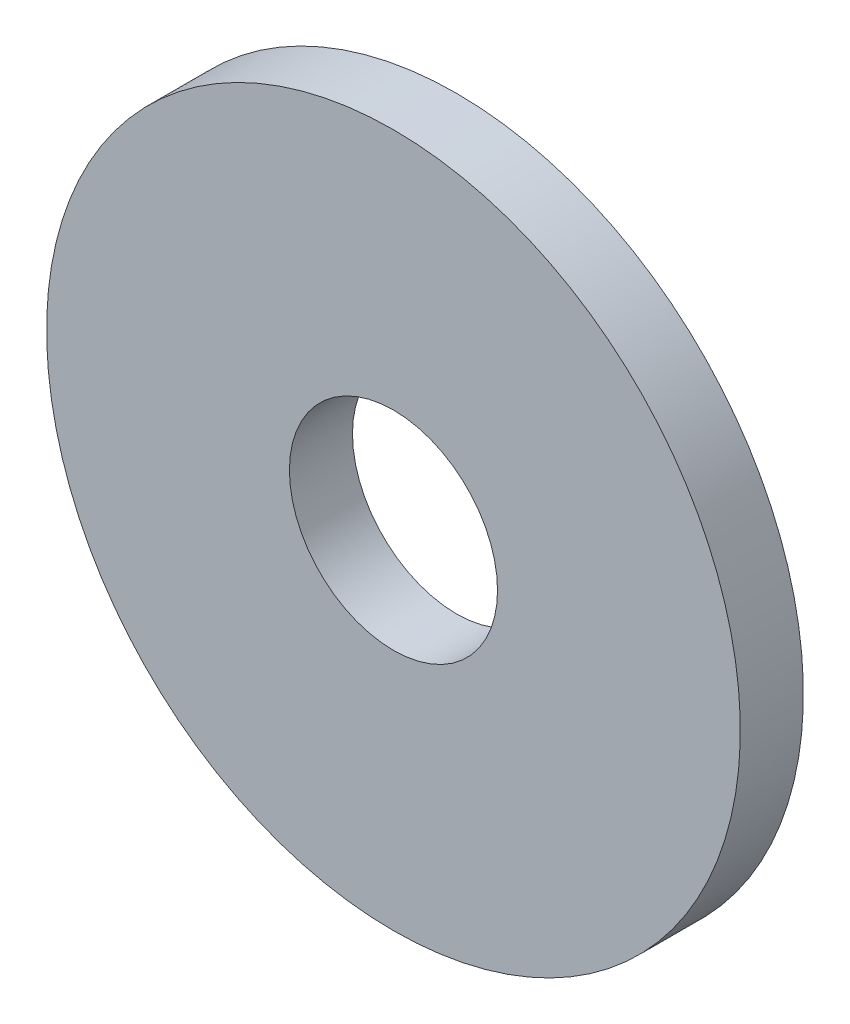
ISO-10303-21;
HEADER;
FILE_DESCRIPTION(('STEP AP214'),'2;1');
FILE_NAME('part.step','',(''),(''),'','','');
FILE_SCHEMA(('AUTOMOTIVE_DESIGN { 1 0 10303 214 1 1 1 1 }'));
ENDSEC;
DATA;
#1=APPLICATION_CONTEXT('core data for automotive mechanical design processes');
#2=APPLICATION_PROTOCOL_DEFINITION('international standard','automotive_design',2000,#1);
#3=PRODUCT_CONTEXT('',#1,'mechanical');
#4=PRODUCT('Part','Part','',(#3));
#5=PRODUCT_RELATED_PRODUCT_CATEGORY('part','',(#4));
#6=PRODUCT_DEFINITION_FORMATION('','',#4);
#7=PRODUCT_DEFINITION_CONTEXT('part definition',#1,'design');
#8=PRODUCT_DEFINITION('design','',#6,#7);
#9=PRODUCT_DEFINITION_SHAPE('','',#8);
#10=(LENGTH_UNIT() NAMED_UNIT(*) SI_UNIT(.MILLI.,.METRE.));
#11=(NAMED_UNIT(*) PLANE_ANGLE_UNIT() SI_UNIT($,.RADIAN.));
#12=(NAMED_UNIT(*) SI_UNIT($,.STERADIAN.) SOLID_ANGLE_UNIT());
#13=UNCERTAINTY_MEASURE_WITH_UNIT(LENGTH_MEASURE(1.E-05),#10,'distance_accuracy_value','');
#14=(GEOMETRIC_REPRESENTATION_CONTEXT(3) GLOBAL_UNCERTAINTY_ASSIGNED_CONTEXT((#13)) GLOBAL_UNIT_ASSIGNED_CONTEXT((#10,
#11,#12)) REPRESENTATION_CONTEXT('',''));
#15=CARTESIAN_POINT('',(0.,0.,0.));
#16=DIRECTION('',(0.,0.,1.));
#17=DIRECTION('',(1.,0.,0.));
#18=AXIS2_PLACEMENT_3D('',#15,#16,#17);
#19=CARTESIAN_POINT('',(0.,0.,0.));
#20=DIRECTION('',(0.,0.,-1.));
#21=DIRECTION('',(0.,1.,0.));
#22=AXIS2_PLACEMENT_3D('',#19,#20,#21);
#23=CYLINDRICAL_SURFACE('',#22,3.3);
#24=CARTESIAN_POINT('',(0.,0.,2.));
#25=DIRECTION('',(0.,0.,-1.));
#26=DIRECTION('',(0.,1.,0.));
#27=AXIS2_PLACEMENT_3D('',#24,#25,#26);
#28=CIRCLE('',#27,3.3);
#29=CARTESIAN_POINT('',(0.,3.3,2.));
#30=VERTEX_POINT('',#29);
#31=EDGE_CURVE('E9',#30,#30,#28,.T.);
#32=ORIENTED_EDGE('',*,*,#31,.F.);
#33=EDGE_LOOP('',(#32));
#34=FACE_BOUND('',#33,.T.);
#35=CARTESIAN_POINT('',(0.,0.,0.));
#36=DIRECTION('',(0.,0.,-1.));
#37=DIRECTION('',(0.,1.,0.));
#38=AXIS2_PLACEMENT_3D('',#35,#36,#37);
#39=CIRCLE('',#38,3.3);
#40=CARTESIAN_POINT('',(0.,3.3,0.));
#41=VERTEX_POINT('',#40);
#42=EDGE_CURVE('E28',#41,#41,#39,.T.);
#43=ORIENTED_EDGE('',*,*,#42,.T.);
#44=EDGE_LOOP('',(#43));
#45=FACE_BOUND('',#44,.T.);
#46=ADVANCED_FACE('F14',(#34,#45),#23,.F.);
#47=CARTESIAN_POINT('',(11.,0.,2.));
#48=DIRECTION('',(0.,0.,1.));
#49=DIRECTION('',(0.,-1.,0.));
#50=AXIS2_PLACEMENT_3D('',#47,#48,#49);
#51=PLANE('',#50);
#52=ORIENTED_EDGE('',*,*,#31,.T.);
#53=EDGE_LOOP('',(#52));
#54=FACE_BOUND('',#53,.T.);
#55=CARTESIAN_POINT('',(0.,0.,2.));
#56=DIRECTION('',(0.,0.,-1.));
#57=DIRECTION('',(0.,1.,0.));
#58=AXIS2_PLACEMENT_3D('',#55,#56,#57);
#59=CIRCLE('',#58,11.);
#60=CARTESIAN_POINT('',(0.,11.,2.));
#61=VERTEX_POINT('',#60);
#62=EDGE_CURVE('E20',#61,#61,#59,.T.);
#63=ORIENTED_EDGE('',*,*,#62,.F.);
#64=EDGE_LOOP('',(#63));
#65=FACE_BOUND('',#64,.T.);
#66=ADVANCED_FACE('F45',(#54,#65),#51,.T.);
#67=CARTESIAN_POINT('',(0.,0.,0.));
#68=DIRECTION('',(0.,0.,-1.));
#69=DIRECTION('',(0.,1.,0.));
#70=AXIS2_PLACEMENT_3D('',#67,#68,#69);
#71=CYLINDRICAL_SURFACE('',#70,11.);
#72=ORIENTED_EDGE('',*,*,#62,.T.);
#73=EDGE_LOOP('',(#72));
#74=FACE_BOUND('',#73,.T.);
#75=CARTESIAN_POINT('',(0.,0.,0.));
#76=DIRECTION('',(0.,0.,-1.));
#77=DIRECTION('',(0.,1.,0.));
#78=AXIS2_PLACEMENT_3D('',#75,#76,#77);
#79=CIRCLE('',#78,11.);
#80=CARTESIAN_POINT('',(0.,11.,0.));
#81=VERTEX_POINT('',#80);
#82=EDGE_CURVE('E24',#81,#81,#79,.T.);
#83=ORIENTED_EDGE('',*,*,#82,.F.);
#84=EDGE_LOOP('',(#83));
#85=FACE_BOUND('',#84,.T.);
#86=ADVANCED_FACE('F37',(#74,#85),#71,.T.);
#87=CARTESIAN_POINT('',(3.3,0.,0.));
#88=DIRECTION('',(0.,0.,-1.));
#89=DIRECTION('',(0.,1.,0.));
#90=AXIS2_PLACEMENT_3D('',#87,#88,#89);
#91=PLANE('',#90);
#92=ORIENTED_EDGE('',*,*,#82,.T.);
#93=EDGE_LOOP('',(#92));
#94=FACE_BOUND('',#93,.T.);
#95=ORIENTED_EDGE('',*,*,#42,.F.);
#96=EDGE_LOOP('',(#95));
#97=FACE_BOUND('',#96,.T.);
#98=ADVANCED_FACE('F35',(#94,#97),#91,.T.);
#99=CLOSED_SHELL('',(#46,#66,#86,#98));
#100=MANIFOLD_SOLID_BREP('B1',#99);
#101=ADVANCED_BREP_SHAPE_REPRESENTATION('',(#18,#100),#14);
#102=SHAPE_DEFINITION_REPRESENTATION(#9,#101);
ENDSEC;
END-ISO-10303-21;
